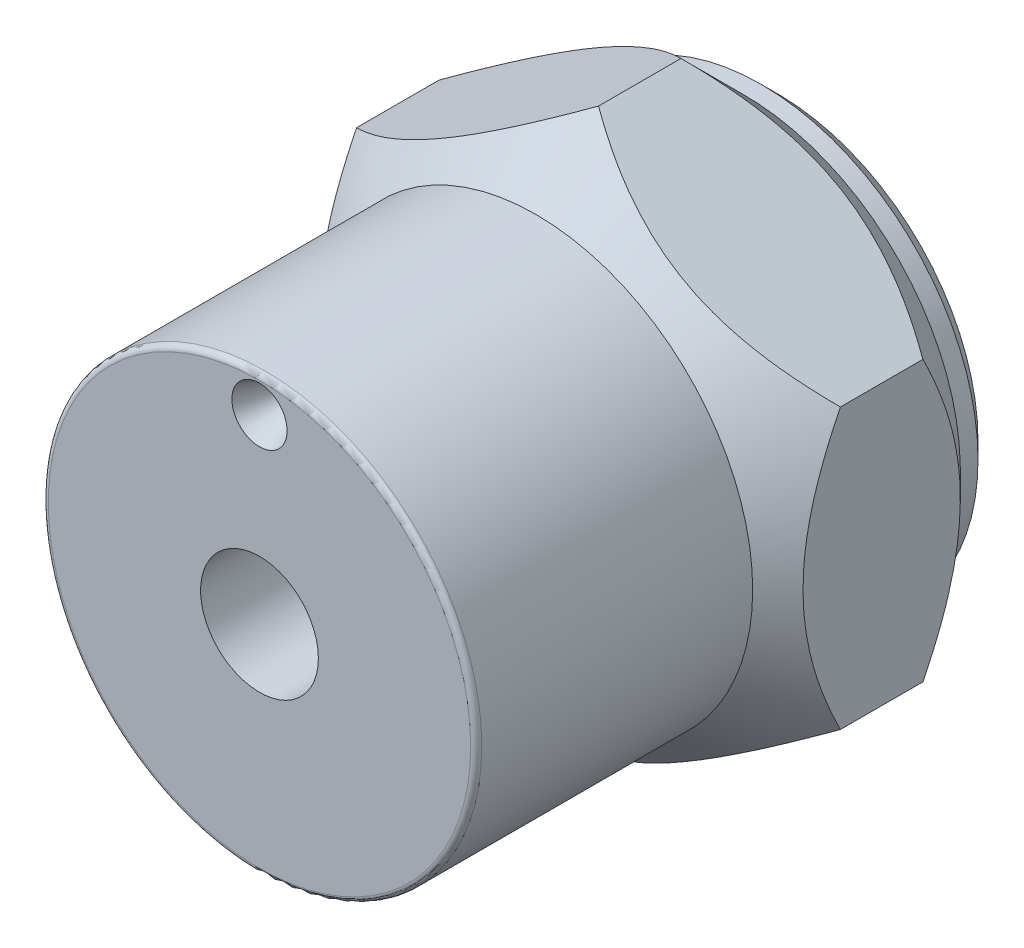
ISO-10303-21;
HEADER;
FILE_DESCRIPTION(('STEP AP214'),'2;1');
FILE_NAME('part.step','',(''),(''),'','','');
FILE_SCHEMA(('AUTOMOTIVE_DESIGN { 1 0 10303 214 1 1 1 1 }'));
ENDSEC;
DATA;
#1=APPLICATION_CONTEXT('core data for automotive mechanical design processes');
#2=APPLICATION_PROTOCOL_DEFINITION('international standard','automotive_design',2000,#1);
#3=PRODUCT_CONTEXT('',#1,'mechanical');
#4=PRODUCT('Part','Part','',(#3));
#5=PRODUCT_RELATED_PRODUCT_CATEGORY('part','',(#4));
#6=PRODUCT_DEFINITION_FORMATION('','',#4);
#7=PRODUCT_DEFINITION_CONTEXT('part definition',#1,'design');
#8=PRODUCT_DEFINITION('design','',#6,#7);
#9=PRODUCT_DEFINITION_SHAPE('','',#8);
#10=(LENGTH_UNIT() NAMED_UNIT(*) SI_UNIT(.MILLI.,.METRE.));
#11=(NAMED_UNIT(*) PLANE_ANGLE_UNIT() SI_UNIT($,.RADIAN.));
#12=(NAMED_UNIT(*) SI_UNIT($,.STERADIAN.) SOLID_ANGLE_UNIT());
#13=UNCERTAINTY_MEASURE_WITH_UNIT(LENGTH_MEASURE(1.E-05),#10,'distance_accuracy_value','');
#14=(GEOMETRIC_REPRESENTATION_CONTEXT(3) GLOBAL_UNCERTAINTY_ASSIGNED_CONTEXT((#13)) GLOBAL_UNIT_ASSIGNED_CONTEXT((#10,
#11,#12)) REPRESENTATION_CONTEXT('',''));
#15=CARTESIAN_POINT('',(0.,0.,0.));
#16=DIRECTION('',(0.,0.,1.));
#17=DIRECTION('',(1.,0.,0.));
#18=AXIS2_PLACEMENT_3D('',#15,#16,#17);
#19=CARTESIAN_POINT('',(0.,-6.41580486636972,11.90625));
#20=DIRECTION('',(-0.500000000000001,0.866025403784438,0.));
#21=DIRECTION('',(-0.866025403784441,-0.5,0.));
#22=AXIS2_PLACEMENT_3D('',#19,#20,#21);
#23=PLANE('',#22);
#24=DIRECTION('',(0.,0.,-1.));
#25=VECTOR('',#24,1.);
#26=CARTESIAN_POINT('',(0.,-6.41580486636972,11.90625));
#27=LINE('',#26,#25);
#28=CARTESIAN_POINT('',(0.,-6.41580486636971,4.11884513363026));
#29=VERTEX_POINT('',#28);
#30=CARTESIAN_POINT('',(0.,-6.41580486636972,2.22480486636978));
#31=VERTEX_POINT('',#30);
#32=EDGE_CURVE('E244',#29,#31,#27,.T.);
#33=ORIENTED_EDGE('',*,*,#32,.T.);
#34=CARTESIAN_POINT('',(-0.000200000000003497,-6.41592033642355,2.2249203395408));
#35=CARTESIAN_POINT('',(0.0953365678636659,-6.36076227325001,2.16976757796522));
#36=CARTESIAN_POINT('',(0.191607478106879,-6.30518023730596,2.11630736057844));
#37=CARTESIAN_POINT('',(0.385762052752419,-6.19308504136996,2.01328688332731));
#38=CARTESIAN_POINT('',(0.483646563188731,-6.13657139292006,1.96372875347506));
#39=CARTESIAN_POINT('',(0.780845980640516,-5.96498322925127,1.82125718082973));
#40=CARTESIAN_POINT('',(0.982676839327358,-5.84845612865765,1.73515435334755));
#41=CARTESIAN_POINT('',(1.38968491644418,-5.6134699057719,1.58770914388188));
#42=CARTESIAN_POINT('',(1.59475810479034,-5.49507084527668,1.52599529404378));
#43=CARTESIAN_POINT('',(1.90573939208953,-5.31552571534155,1.45460749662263));
#44=CARTESIAN_POINT('',(2.00985767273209,-5.255412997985,1.43435160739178));
#45=CARTESIAN_POINT('',(2.21897582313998,-5.13467857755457,1.40135919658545));
#46=CARTESIAN_POINT('',(2.32397555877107,-5.07405695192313,1.38862155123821));
#47=CARTESIAN_POINT('',(2.57984446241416,-4.92633097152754,1.36726512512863));
#48=CARTESIAN_POINT('',(2.7309893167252,-4.83906744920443,1.36278407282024));
#49=CARTESIAN_POINT('',(3.03300662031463,-4.66469767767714,1.37030480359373));
#50=CARTESIAN_POINT('',(3.18387895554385,-4.57759149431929,1.38231236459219));
#51=CARTESIAN_POINT('',(3.48420123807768,-4.40420034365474,1.42210252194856));
#52=CARTESIAN_POINT('',(3.63364940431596,-4.31791640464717,1.44990275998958));
#53=CARTESIAN_POINT('',(3.92997709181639,-4.14683153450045,1.51976687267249));
#54=CARTESIAN_POINT('',(4.0768568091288,-4.06203049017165,1.56182965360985));
#55=CARTESIAN_POINT('',(4.33759648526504,-3.91149236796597,1.64836636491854));
#56=CARTESIAN_POINT('',(4.45203376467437,-3.84542197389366,1.69056454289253));
#57=CARTESIAN_POINT('',(4.67885400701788,-3.71446724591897,1.7817611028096));
#58=CARTESIAN_POINT('',(4.79123690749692,-3.64958294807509,1.83075969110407));
#59=CARTESIAN_POINT('',(5.01359442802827,-3.52120477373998,1.93445867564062));
#60=CARTESIAN_POINT('',(5.12357537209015,-3.45770724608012,1.98914114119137));
#61=CARTESIAN_POINT('',(5.34150068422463,-3.33188800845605,2.10348993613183));
#62=CARTESIAN_POINT('',(5.44944625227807,-3.26956560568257,2.16315320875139));
#63=CARTESIAN_POINT('',(5.55645000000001,-3.20778696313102,2.2249203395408));
#64=B_SPLINE_CURVE_WITH_KNOTS('',3,(#34,#35,#36,#37,#38,#39,#40,#41,#42,#43,#44,#45,#46,#47,#48,
#49,#50,#51,#52,#53,#54,#55,#56,#57,#58,#59,#60,#61,#62,#63),.UNSPECIFIED.,.F.,.F.,(4,2,2,2,2,2,
2,2,2,2,2,2,2,2,4),(0.,0.369982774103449,0.740166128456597,1.48452951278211,2.21707291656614,
2.58262618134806,2.94812479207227,3.47106468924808,3.99418788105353,4.51789659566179,
5.04156515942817,5.45751515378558,5.87347777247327,6.28816585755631,6.70260128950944),.UNSPECIFIED.);
#65=CARTESIAN_POINT('',(5.55625000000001,-3.20790243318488,2.22480486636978));
#66=VERTEX_POINT('',#65);
#67=EDGE_CURVE('E53',#31,#66,#64,.T.);
#68=ORIENTED_EDGE('',*,*,#67,.T.);
#69=DIRECTION('',(0.,0.,-1.));
#70=VECTOR('',#69,1.);
#71=CARTESIAN_POINT('',(5.55625000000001,-3.20790243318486,11.90625));
#72=LINE('',#71,#70);
#73=CARTESIAN_POINT('',(5.55625000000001,-3.20790243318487,4.11884513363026));
#74=VERTEX_POINT('',#73);
#75=EDGE_CURVE('E259',#74,#66,#72,.T.);
#76=ORIENTED_EDGE('',*,*,#75,.F.);
#77=CARTESIAN_POINT('',(5.55645000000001,-3.20778696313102,4.11872966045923));
#78=CARTESIAN_POINT('',(5.46091343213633,-3.26294502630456,4.1738824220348));
#79=CARTESIAN_POINT('',(5.36464252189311,-3.31852706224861,4.22734263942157));
#80=CARTESIAN_POINT('',(5.17048794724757,-3.43062225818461,4.3303631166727));
#81=CARTESIAN_POINT('',(5.07260343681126,-3.48713590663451,4.37992124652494));
#82=CARTESIAN_POINT('',(4.77540401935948,-3.65872407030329,4.52239281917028));
#83=CARTESIAN_POINT('',(4.57357316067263,-3.77525117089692,4.60849564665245));
#84=CARTESIAN_POINT('',(4.16656508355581,-4.01023739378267,4.75594085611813));
#85=CARTESIAN_POINT('',(3.96149189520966,-4.12863645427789,4.81765470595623));
#86=CARTESIAN_POINT('',(3.65051060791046,-4.30818158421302,4.88904250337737));
#87=CARTESIAN_POINT('',(3.54639232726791,-4.36829430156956,4.90929839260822));
#88=CARTESIAN_POINT('',(3.33727417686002,-4.48902872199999,4.94229080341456));
#89=CARTESIAN_POINT('',(3.23227444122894,-4.54965034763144,4.95502844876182));
#90=CARTESIAN_POINT('',(2.97640553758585,-4.69737632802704,4.97638487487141));
#91=CARTESIAN_POINT('',(2.82526068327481,-4.78463985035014,4.98086592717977));
#92=CARTESIAN_POINT('',(2.52324337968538,-4.95900962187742,4.97334519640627));
#93=CARTESIAN_POINT('',(2.37237104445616,-5.04611580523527,4.96133763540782));
#94=CARTESIAN_POINT('',(2.07204876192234,-5.21950695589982,4.92154747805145));
#95=CARTESIAN_POINT('',(1.92260059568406,-5.30579089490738,4.89374724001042));
#96=CARTESIAN_POINT('',(1.62627290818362,-5.4768757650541,4.82388312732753));
#97=CARTESIAN_POINT('',(1.47939319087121,-5.56167680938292,4.78182034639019));
#98=CARTESIAN_POINT('',(1.21865351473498,-5.71221493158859,4.69528363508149));
#99=CARTESIAN_POINT('',(1.10421623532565,-5.77828532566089,4.65308545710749));
#100=CARTESIAN_POINT('',(0.877395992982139,-5.90924005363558,4.5618888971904));
#101=CARTESIAN_POINT('',(0.765013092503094,-5.97412435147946,4.51289030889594));
#102=CARTESIAN_POINT('',(0.542655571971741,-6.10250252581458,4.40919132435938));
#103=CARTESIAN_POINT('',(0.432674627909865,-6.16600005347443,4.35450885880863));
#104=CARTESIAN_POINT('',(0.21474931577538,-6.29181929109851,4.24016006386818));
#105=CARTESIAN_POINT('',(0.106803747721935,-6.35414169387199,4.18049679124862));
#106=CARTESIAN_POINT('',(-0.000200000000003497,-6.41592033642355,4.11872966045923));
#107=B_SPLINE_CURVE_WITH_KNOTS('',3,(#77,#78,#79,#80,#81,#82,#83,#84,#85,#86,#87,#88,#89,#90,
#91,#92,#93,#94,#95,#96,#97,#98,#99,#100,#101,#102,#103,#104,#105,#106),.UNSPECIFIED.,.F.,.F.,
(4,2,2,2,2,2,2,2,2,2,2,2,2,2,4),(0.,0.369982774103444,0.740166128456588,1.4845295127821,
2.21707291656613,2.58262618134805,2.94812479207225,3.47106468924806,3.9941878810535,
4.51789659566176,5.04156515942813,5.45751515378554,5.87347777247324,6.28816585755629,
6.70260128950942),.UNSPECIFIED.);
#108=EDGE_CURVE('E198',#74,#29,#107,.T.);
#109=ORIENTED_EDGE('',*,*,#108,.T.);
#110=EDGE_LOOP('',(#33,#68,#76,#109));
#111=FACE_BOUND('',#110,.T.);
#112=ADVANCED_FACE('F30',(#111),#23,.F.);
#113=CARTESIAN_POINT('',(5.55625000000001,-3.20790243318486,11.90625));
#114=DIRECTION('',(-1.,0.,0.));
#115=DIRECTION('',(0.,-0.999999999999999,0.));
#116=AXIS2_PLACEMENT_3D('',#113,#114,#115);
#117=PLANE('',#116);
#118=ORIENTED_EDGE('',*,*,#75,.T.);
#119=CARTESIAN_POINT('',(5.55625000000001,-6.46362210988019,4.33251599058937));
#120=CARTESIAN_POINT('',(5.55625000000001,-6.3065329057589,4.21341784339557));
#121=CARTESIAN_POINT('',(5.55625000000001,-6.14857156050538,4.09545146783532));
#122=CARTESIAN_POINT('',(5.55625000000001,-5.83055773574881,3.86229133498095));
#123=CARTESIAN_POINT('',(5.55625000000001,-5.67050474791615,3.74709827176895));
#124=CARTESIAN_POINT('',(5.55625000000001,-5.34678986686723,3.51917436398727));
#125=CARTESIAN_POINT('',(5.55625000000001,-5.18310962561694,3.40646949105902));
#126=CARTESIAN_POINT('',(5.55625000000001,-4.8529824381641,3.18520073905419));
#127=CARTESIAN_POINT('',(5.55625000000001,-4.68653568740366,3.07663656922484));
#128=CARTESIAN_POINT('',(5.55625000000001,-4.34059266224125,2.85836881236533));
#129=CARTESIAN_POINT('',(5.55625000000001,-4.16090281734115,2.74897047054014));
#130=CARTESIAN_POINT('',(5.55625000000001,-3.79732199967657,2.53727735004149));
#131=CARTESIAN_POINT('',(5.55625000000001,-3.61343035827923,2.43498371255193));
#132=CARTESIAN_POINT('',(5.55625000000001,-3.24144791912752,2.23970086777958));
#133=CARTESIAN_POINT('',(5.55625000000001,-3.05337159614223,2.14668430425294));
#134=CARTESIAN_POINT('',(5.55625000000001,-2.67204648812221,1.97203841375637));
#135=CARTESIAN_POINT('',(5.55625000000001,-2.47880011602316,1.89040388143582));
#136=CARTESIAN_POINT('',(5.55625000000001,-2.10341456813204,1.74775034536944));
#137=CARTESIAN_POINT('',(5.55625000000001,-1.92172099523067,1.68557085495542));
#138=CARTESIAN_POINT('',(5.55625000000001,-1.55390192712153,1.57577964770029));
#139=CARTESIAN_POINT('',(5.55625000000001,-1.36777613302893,1.52816891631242));
#140=CARTESIAN_POINT('',(5.55625000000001,-0.995331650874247,1.45081352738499));
#141=CARTESIAN_POINT('',(5.55625000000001,-0.80907845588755,1.42075871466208));
#142=CARTESIAN_POINT('',(5.55625000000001,-0.434508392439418,1.3791089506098));
#143=CARTESIAN_POINT('',(5.55625000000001,-0.246191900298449,1.36751068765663));
#144=CARTESIAN_POINT('',(5.55625000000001,0.123517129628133,1.36366417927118));
#145=CARTESIAN_POINT('',(5.55625,0.304902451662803,1.37070141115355));
#146=CARTESIAN_POINT('',(5.55625,0.666151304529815,1.40214514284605));
#147=CARTESIAN_POINT('',(5.55625,0.846014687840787,1.42655330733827));
#148=CARTESIAN_POINT('',(5.55625,1.20596003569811,1.49181154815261));
#149=CARTESIAN_POINT('',(5.55625,1.3859900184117,1.5329437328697));
#150=CARTESIAN_POINT('',(5.55625000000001,1.74211887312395,1.62943678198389));
#151=CARTESIAN_POINT('',(5.55625000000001,1.91821804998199,1.68479653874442));
#152=CARTESIAN_POINT('',(5.55625000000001,2.28095281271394,1.81261832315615));
#153=CARTESIAN_POINT('',(5.55625,2.46721345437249,1.88613336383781));
#154=CARTESIAN_POINT('',(5.55625,2.83490880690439,2.04446817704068));
#155=CARTESIAN_POINT('',(5.55625,3.01634124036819,2.12929317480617));
#156=CARTESIAN_POINT('',(5.55625,3.37525935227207,2.30823154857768));
#157=CARTESIAN_POINT('',(5.55625,3.55273043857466,2.40237395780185));
#158=CARTESIAN_POINT('',(5.55625,3.90359298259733,2.59786857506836));
#159=CARTESIAN_POINT('',(5.55625,4.07698507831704,2.69921964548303));
#160=CARTESIAN_POINT('',(5.55625,4.4117075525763,2.90253922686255));
#161=CARTESIAN_POINT('',(5.55625,4.57320929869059,3.00422710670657));
#162=CARTESIAN_POINT('',(5.55625,4.89343958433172,3.21189254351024));
#163=CARTESIAN_POINT('',(5.55625,5.05216791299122,3.31787042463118));
#164=CARTESIAN_POINT('',(5.55625,5.36592978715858,3.53247724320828));
#165=CARTESIAN_POINT('',(5.55625,5.52098284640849,3.64107775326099));
#166=CARTESIAN_POINT('',(5.55625,5.82896783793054,3.86116087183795));
#167=CARTESIAN_POINT('',(5.55625,5.98190034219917,3.97264267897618));
#168=CARTESIAN_POINT('',(5.55625,6.13394446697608,4.08530284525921));
#169=B_SPLINE_CURVE_WITH_KNOTS('',3,(#119,#120,#121,#122,#123,#124,#125,#126,#127,#128,#129,
#130,#131,#132,#133,#134,#135,#136,#137,#138,#139,#140,#141,#142,#143,#144,#145,#146,#147,#148,
#149,#150,#151,#152,#153,#154,#155,#156,#157,#158,#159,#160,#161,#162,#163,#164,#165,#166,#167,
#168),.UNSPECIFIED.,.F.,.F.,(4,2,2,2,2,2,2,2,2,2,2,2,2,2,2,2,2,2,2,2,2,2,2,2,4),(0.,
0.591410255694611,1.1829670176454,1.77910425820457,2.37519956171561,3.00618537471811,
3.63727230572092,4.26643955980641,4.89531812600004,5.4709302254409,6.04658125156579,
6.6117281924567,7.17677371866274,7.72047079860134,8.26421998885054,8.81754933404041,
9.3708356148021,9.97110049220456,10.5716436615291,11.1741208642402,11.7765031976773,
12.3489697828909,12.9214797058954,13.489352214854,14.0570684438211),.UNSPECIFIED.);
#170=CARTESIAN_POINT('',(5.55625000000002,3.20790243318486,2.22480486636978));
#171=VERTEX_POINT('',#170);
#172=EDGE_CURVE('E211',#66,#171,#169,.T.);
#173=ORIENTED_EDGE('',*,*,#172,.T.);
#174=DIRECTION('',(0.,0.,-1.));
#175=VECTOR('',#174,1.);
#176=CARTESIAN_POINT('',(5.55625000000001,3.20790243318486,11.90625));
#177=LINE('',#176,#175);
#178=CARTESIAN_POINT('',(5.55625000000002,3.20790243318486,4.11884513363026));
#179=VERTEX_POINT('',#178);
#180=EDGE_CURVE('E257',#179,#171,#177,.T.);
#181=ORIENTED_EDGE('',*,*,#180,.F.);
#182=CARTESIAN_POINT('',(5.55625000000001,-6.46362210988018,2.01113400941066));
#183=CARTESIAN_POINT('',(5.55625000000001,-6.30653290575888,2.13023215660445));
#184=CARTESIAN_POINT('',(5.55625000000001,-6.14857156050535,2.24819853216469));
#185=CARTESIAN_POINT('',(5.55625000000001,-5.83055773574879,2.48135866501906));
#186=CARTESIAN_POINT('',(5.55625000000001,-5.67050474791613,2.59655172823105));
#187=CARTESIAN_POINT('',(5.55625000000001,-5.34678986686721,2.82447563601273));
#188=CARTESIAN_POINT('',(5.55625000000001,-5.18310962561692,2.93718050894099));
#189=CARTESIAN_POINT('',(5.55625000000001,-4.85298243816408,3.15844926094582));
#190=CARTESIAN_POINT('',(5.55625000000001,-4.68653568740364,3.26701343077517));
#191=CARTESIAN_POINT('',(5.55625000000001,-4.34059266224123,3.48528118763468));
#192=CARTESIAN_POINT('',(5.55625000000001,-4.16090281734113,3.59467952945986));
#193=CARTESIAN_POINT('',(5.55625000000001,-3.79732199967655,3.80637264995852));
#194=CARTESIAN_POINT('',(5.55625000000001,-3.61343035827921,3.90866628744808));
#195=CARTESIAN_POINT('',(5.55625000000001,-3.24144791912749,4.10394913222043));
#196=CARTESIAN_POINT('',(5.55625000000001,-3.0533715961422,4.19696569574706));
#197=CARTESIAN_POINT('',(5.55625000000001,-2.6720464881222,4.37161158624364));
#198=CARTESIAN_POINT('',(5.55625000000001,-2.47880011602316,4.45324611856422));
#199=CARTESIAN_POINT('',(5.55625000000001,-2.10341456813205,4.59589965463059));
#200=CARTESIAN_POINT('',(5.55625000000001,-1.92172099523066,4.65807914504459));
#201=CARTESIAN_POINT('',(5.55625000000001,-1.55390192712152,4.76787035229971));
#202=CARTESIAN_POINT('',(5.55625000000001,-1.36777613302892,4.81548108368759));
#203=CARTESIAN_POINT('',(5.55625000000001,-0.995331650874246,4.89283647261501));
#204=CARTESIAN_POINT('',(5.55625,-0.809078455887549,4.92289128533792));
#205=CARTESIAN_POINT('',(5.55625000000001,-0.434508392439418,4.96454104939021));
#206=CARTESIAN_POINT('',(5.55625000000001,-0.246191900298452,4.9761393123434));
#207=CARTESIAN_POINT('',(5.55625000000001,0.123517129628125,4.97998582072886));
#208=CARTESIAN_POINT('',(5.55625000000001,0.304902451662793,4.97294858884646));
#209=CARTESIAN_POINT('',(5.55625,0.666151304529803,4.94150485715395));
#210=CARTESIAN_POINT('',(5.55625,0.846014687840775,4.91709669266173));
#211=CARTESIAN_POINT('',(5.55625,1.20596003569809,4.8518384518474));
#212=CARTESIAN_POINT('',(5.55625,1.38599001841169,4.8107062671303));
#213=CARTESIAN_POINT('',(5.55625,1.74211887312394,4.71421321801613));
#214=CARTESIAN_POINT('',(5.55625,1.91821804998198,4.65885346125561));
#215=CARTESIAN_POINT('',(5.55625,2.28095281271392,4.53103167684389));
#216=CARTESIAN_POINT('',(5.55625,2.46721345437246,4.45751663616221));
#217=CARTESIAN_POINT('',(5.55625,2.83490880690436,4.29918182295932));
#218=CARTESIAN_POINT('',(5.55625,3.01634124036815,4.21435682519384));
#219=CARTESIAN_POINT('',(5.55625,3.37525935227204,4.03541845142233));
#220=CARTESIAN_POINT('',(5.55625,3.55273043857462,3.94127604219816));
#221=CARTESIAN_POINT('',(5.55625,3.90359298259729,3.74578142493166));
#222=CARTESIAN_POINT('',(5.55625,4.076985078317,3.64443035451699));
#223=CARTESIAN_POINT('',(5.55625,4.41170755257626,3.44111077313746));
#224=CARTESIAN_POINT('',(5.55625,4.57320929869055,3.33942289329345));
#225=CARTESIAN_POINT('',(5.55625,4.89343958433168,3.13175745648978));
#226=CARTESIAN_POINT('',(5.55625,5.05216791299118,3.02577957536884));
#227=CARTESIAN_POINT('',(5.55625,5.36592978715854,2.81117275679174));
#228=CARTESIAN_POINT('',(5.55625,5.52098284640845,2.70257224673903));
#229=CARTESIAN_POINT('',(5.55625,5.8289678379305,2.48248912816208));
#230=CARTESIAN_POINT('',(5.55625,5.98190034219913,2.37100732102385));
#231=CARTESIAN_POINT('',(5.55625,6.13394446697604,2.25834715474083));
#232=B_SPLINE_CURVE_WITH_KNOTS('',3,(#182,#183,#184,#185,#186,#187,#188,#189,#190,#191,#192,
#193,#194,#195,#196,#197,#198,#199,#200,#201,#202,#203,#204,#205,#206,#207,#208,#209,#210,#211,
#212,#213,#214,#215,#216,#217,#218,#219,#220,#221,#222,#223,#224,#225,#226,#227,#228,#229,#230,
#231),.UNSPECIFIED.,.F.,.F.,(4,2,2,2,2,2,2,2,2,2,2,2,2,2,2,2,2,2,2,2,2,2,2,2,4),(0.,
0.591410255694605,1.18296701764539,1.77910425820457,2.3751995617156,3.0061853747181,
3.63727230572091,4.2664395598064,4.89531812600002,5.47093022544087,6.04658125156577,
6.61172819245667,7.17677371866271,7.72047079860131,8.2642199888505,8.81754933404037,
9.37083561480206,9.97110049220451,10.571643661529,11.1741208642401,11.7765031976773,
12.3489697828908,12.9214797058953,13.489352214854,14.0570684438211),.UNSPECIFIED.);
#233=EDGE_CURVE('E193',#179,#74,#232,.F.);
#234=ORIENTED_EDGE('',*,*,#233,.T.);
#235=EDGE_LOOP('',(#118,#173,#181,#234));
#236=FACE_BOUND('',#235,.T.);
#237=ADVANCED_FACE('F203',(#236),#117,.F.);
#238=CARTESIAN_POINT('',(5.55625000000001,3.20790243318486,11.90625));
#239=DIRECTION('',(-0.500000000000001,-0.866025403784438,0.));
#240=DIRECTION('',(0.866025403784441,-0.5,0.));
#241=AXIS2_PLACEMENT_3D('',#238,#239,#240);
#242=PLANE('',#241);
#243=ORIENTED_EDGE('',*,*,#180,.T.);
#244=CARTESIAN_POINT('',(5.55645,3.20778696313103,2.2249203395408));
#245=CARTESIAN_POINT('',(5.46091343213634,3.26294502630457,2.16976757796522));
#246=CARTESIAN_POINT('',(5.36464252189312,3.31852706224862,2.11630736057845));
#247=CARTESIAN_POINT('',(5.17048794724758,3.43062225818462,2.01328688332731));
#248=CARTESIAN_POINT('',(5.07260343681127,3.48713590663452,1.96372875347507));
#249=CARTESIAN_POINT('',(4.77540401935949,3.65872407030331,1.82125718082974));
#250=CARTESIAN_POINT('',(4.57357316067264,3.77525117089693,1.73515435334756));
#251=CARTESIAN_POINT('',(4.16656508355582,4.01023739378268,1.58770914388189));
#252=CARTESIAN_POINT('',(3.96149189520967,4.1286364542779,1.52599529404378));
#253=CARTESIAN_POINT('',(3.65051060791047,4.30818158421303,1.45460749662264));
#254=CARTESIAN_POINT('',(3.54639232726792,4.36829430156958,1.4343516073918));
#255=CARTESIAN_POINT('',(3.33727417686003,4.489028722,1.40135919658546));
#256=CARTESIAN_POINT('',(3.23227444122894,4.54965034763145,1.38862155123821));
#257=CARTESIAN_POINT('',(2.97640553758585,4.69737632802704,1.36726512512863));
#258=CARTESIAN_POINT('',(2.82526068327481,4.78463985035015,1.36278407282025));
#259=CARTESIAN_POINT('',(2.52324337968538,4.95900962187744,1.37030480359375));
#260=CARTESIAN_POINT('',(2.37237104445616,5.04611580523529,1.3823123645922));
#261=CARTESIAN_POINT('',(2.07204876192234,5.21950695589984,1.42210252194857));
#262=CARTESIAN_POINT('',(1.92260059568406,5.30579089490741,1.4499027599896));
#263=CARTESIAN_POINT('',(1.62627290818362,5.47687576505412,1.5197668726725));
#264=CARTESIAN_POINT('',(1.4793931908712,5.56167680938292,1.56182965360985));
#265=CARTESIAN_POINT('',(1.21865351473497,5.7122149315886,1.64836636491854));
#266=CARTESIAN_POINT('',(1.10421623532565,5.77828532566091,1.69056454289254));
#267=CARTESIAN_POINT('',(0.877395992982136,5.9092400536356,1.78176110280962));
#268=CARTESIAN_POINT('',(0.76501309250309,5.97412435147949,1.83075969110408));
#269=CARTESIAN_POINT('',(0.542655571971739,6.1025025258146,1.93445867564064));
#270=CARTESIAN_POINT('',(0.432674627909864,6.16600005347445,1.98914114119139));
#271=CARTESIAN_POINT('',(0.21474931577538,6.29181929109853,2.10348993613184));
#272=CARTESIAN_POINT('',(0.106803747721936,6.35414169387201,2.1631532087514));
#273=CARTESIAN_POINT('',(-0.000200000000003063,6.41592033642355,2.2249203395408));
#274=B_SPLINE_CURVE_WITH_KNOTS('',3,(#244,#245,#246,#247,#248,#249,#250,#251,#252,#253,#254,
#255,#256,#257,#258,#259,#260,#261,#262,#263,#264,#265,#266,#267,#268,#269,#270,#271,#272,#273),
.UNSPECIFIED.,.F.,.F.,(4,2,2,2,2,2,2,2,2,2,2,2,2,2,4),(0.,0.369982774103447,0.740166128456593,
1.4845295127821,2.21707291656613,2.58262618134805,2.94812479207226,3.47106468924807,
3.99418788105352,4.51789659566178,5.04156515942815,5.45751515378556,5.87347777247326,
6.2881658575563,6.70260128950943),.UNSPECIFIED.);
#275=CARTESIAN_POINT('',(0.,6.41580486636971,2.22480486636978));
#276=VERTEX_POINT('',#275);
#277=EDGE_CURVE('E216',#171,#276,#274,.T.);
#278=ORIENTED_EDGE('',*,*,#277,.T.);
#279=DIRECTION('',(0.,0.,-1.));
#280=VECTOR('',#279,1.);
#281=CARTESIAN_POINT('',(0.,6.41580486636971,11.90625));
#282=LINE('',#281,#280);
#283=CARTESIAN_POINT('',(0.,6.41580486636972,4.11884513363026));
#284=VERTEX_POINT('',#283);
#285=EDGE_CURVE('E254',#284,#276,#282,.T.);
#286=ORIENTED_EDGE('',*,*,#285,.F.);
#287=CARTESIAN_POINT('',(-0.000200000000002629,6.41592033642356,4.11872966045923));
#288=CARTESIAN_POINT('',(0.0953365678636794,6.36076227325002,4.17388242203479));
#289=CARTESIAN_POINT('',(0.191607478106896,6.30518023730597,4.22734263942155));
#290=CARTESIAN_POINT('',(0.385762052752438,6.19308504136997,4.33036311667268));
#291=CARTESIAN_POINT('',(0.483646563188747,6.13657139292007,4.37992124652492));
#292=CARTESIAN_POINT('',(0.78084598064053,5.96498322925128,4.52239281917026));
#293=CARTESIAN_POINT('',(0.982676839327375,5.84845612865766,4.60849564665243));
#294=CARTESIAN_POINT('',(1.3896849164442,5.61346990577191,4.75594085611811));
#295=CARTESIAN_POINT('',(1.59475810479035,5.49507084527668,4.81765470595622));
#296=CARTESIAN_POINT('',(1.90573939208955,5.31552571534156,4.88904250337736));
#297=CARTESIAN_POINT('',(2.00985767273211,5.25541299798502,4.9092983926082));
#298=CARTESIAN_POINT('',(2.21897582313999,5.13467857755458,4.94229080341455));
#299=CARTESIAN_POINT('',(2.32397555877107,5.07405695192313,4.95502844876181));
#300=CARTESIAN_POINT('',(2.57984446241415,4.92633097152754,4.97638487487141));
#301=CARTESIAN_POINT('',(2.7309893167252,4.83906744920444,4.98086592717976));
#302=CARTESIAN_POINT('',(3.03300662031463,4.66469767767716,4.97334519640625));
#303=CARTESIAN_POINT('',(3.18387895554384,4.57759149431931,4.9613376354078));
#304=CARTESIAN_POINT('',(3.48420123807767,4.40420034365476,4.92154747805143));
#305=CARTESIAN_POINT('',(3.63364940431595,4.3179164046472,4.8937472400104));
#306=CARTESIAN_POINT('',(3.92997709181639,4.14683153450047,4.82388312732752));
#307=CARTESIAN_POINT('',(4.07685680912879,4.06203049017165,4.78182034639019));
#308=CARTESIAN_POINT('',(4.33759648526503,3.91149236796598,4.69528363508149));
#309=CARTESIAN_POINT('',(4.45203376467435,3.84542197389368,4.65308545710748));
#310=CARTESIAN_POINT('',(4.67885400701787,3.714467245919,4.56188889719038));
#311=CARTESIAN_POINT('',(4.79123690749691,3.64958294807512,4.51289030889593));
#312=CARTESIAN_POINT('',(5.01359442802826,3.52120477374,4.40919132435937));
#313=CARTESIAN_POINT('',(5.12357537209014,3.45770724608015,4.35450885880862));
#314=CARTESIAN_POINT('',(5.34150068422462,3.33188800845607,4.24016006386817));
#315=CARTESIAN_POINT('',(5.44944625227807,3.26956560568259,4.18049679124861));
#316=CARTESIAN_POINT('',(5.55645000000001,3.20778696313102,4.11872966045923));
#317=B_SPLINE_CURVE_WITH_KNOTS('',3,(#287,#288,#289,#290,#291,#292,#293,#294,#295,#296,#297,
#298,#299,#300,#301,#302,#303,#304,#305,#306,#307,#308,#309,#310,#311,#312,#313,#314,#315,#316),
.UNSPECIFIED.,.F.,.F.,(4,2,2,2,2,2,2,2,2,2,2,2,2,2,4),(0.,0.369982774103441,0.740166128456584,
1.4845295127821,2.21707291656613,2.58262618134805,2.94812479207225,3.47106468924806,
3.9941878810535,4.51789659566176,5.04156515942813,5.45751515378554,5.87347777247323,
6.28816585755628,6.70260128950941),.UNSPECIFIED.);
#318=EDGE_CURVE('E188',#284,#179,#317,.T.);
#319=ORIENTED_EDGE('',*,*,#318,.T.);
#320=EDGE_LOOP('',(#243,#278,#286,#319));
#321=FACE_BOUND('',#320,.T.);
#322=ADVANCED_FACE('F206',(#321),#242,.F.);
#323=CARTESIAN_POINT('',(0.,6.41580486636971,11.90625));
#324=DIRECTION('',(0.500000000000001,-0.866025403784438,0.));
#325=DIRECTION('',(0.866025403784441,0.499999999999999,0.));
#326=AXIS2_PLACEMENT_3D('',#323,#324,#325);
#327=PLANE('',#326);
#328=ORIENTED_EDGE('',*,*,#285,.T.);
#329=CARTESIAN_POINT('',(0.000199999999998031,6.41592033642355,2.2249203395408));
#330=CARTESIAN_POINT('',(-0.0953365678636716,6.36076227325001,2.16976757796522));
#331=CARTESIAN_POINT('',(-0.191607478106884,6.30518023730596,2.11630736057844));
#332=CARTESIAN_POINT('',(-0.385762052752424,6.19308504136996,2.01328688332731));
#333=CARTESIAN_POINT('',(-0.483646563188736,6.13657139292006,1.96372875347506));
#334=CARTESIAN_POINT('',(-0.780845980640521,5.96498322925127,1.82125718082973));
#335=CARTESIAN_POINT('',(-0.982676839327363,5.84845612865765,1.73515435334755));
#336=CARTESIAN_POINT('',(-1.38968491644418,5.6134699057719,1.58770914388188));
#337=CARTESIAN_POINT('',(-1.59475810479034,5.49507084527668,1.52599529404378));
#338=CARTESIAN_POINT('',(-1.90573939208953,5.31552571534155,1.45460749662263));
#339=CARTESIAN_POINT('',(-2.00985767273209,5.255412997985,1.43435160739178));
#340=CARTESIAN_POINT('',(-2.21897582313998,5.13467857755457,1.40135919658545));
#341=CARTESIAN_POINT('',(-2.32397555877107,5.07405695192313,1.38862155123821));
#342=CARTESIAN_POINT('',(-2.57984446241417,4.92633097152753,1.36726512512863));
#343=CARTESIAN_POINT('',(-2.7309893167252,4.83906744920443,1.36278407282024));
#344=CARTESIAN_POINT('',(-3.03300662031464,4.66469767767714,1.37030480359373));
#345=CARTESIAN_POINT('',(-3.18387895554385,4.57759149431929,1.38231236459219));
#346=CARTESIAN_POINT('',(-3.48420123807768,4.40420034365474,1.42210252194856));
#347=CARTESIAN_POINT('',(-3.63364940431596,4.31791640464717,1.44990275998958));
#348=CARTESIAN_POINT('',(-3.9299770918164,4.14683153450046,1.51976687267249));
#349=CARTESIAN_POINT('',(-4.07685680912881,4.06203049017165,1.56182965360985));
#350=CARTESIAN_POINT('',(-4.33759648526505,3.91149236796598,1.64836636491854));
#351=CARTESIAN_POINT('',(-4.45203376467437,3.84542197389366,1.69056454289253));
#352=CARTESIAN_POINT('',(-4.67885400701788,3.71446724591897,1.7817611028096));
#353=CARTESIAN_POINT('',(-4.79123690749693,3.64958294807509,1.83075969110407));
#354=CARTESIAN_POINT('',(-5.01359442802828,3.52120477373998,1.93445867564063));
#355=CARTESIAN_POINT('',(-5.12357537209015,3.45770724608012,1.98914114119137));
#356=CARTESIAN_POINT('',(-5.34150068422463,3.33188800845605,2.10348993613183));
#357=CARTESIAN_POINT('',(-5.44944625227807,3.26956560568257,2.16315320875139));
#358=CARTESIAN_POINT('',(-5.55645000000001,3.20778696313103,2.2249203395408));
#359=B_SPLINE_CURVE_WITH_KNOTS('',3,(#329,#330,#331,#332,#333,#334,#335,#336,#337,#338,#339,
#340,#341,#342,#343,#344,#345,#346,#347,#348,#349,#350,#351,#352,#353,#354,#355,#356,#357,#358),
.UNSPECIFIED.,.F.,.F.,(4,2,2,2,2,2,2,2,2,2,2,2,2,2,4),(0.,0.369982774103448,0.740166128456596,
1.4845295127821,2.21707291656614,2.58262618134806,2.94812479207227,3.47106468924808,
3.99418788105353,4.51789659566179,5.04156515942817,5.45751515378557,5.87347777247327,
6.28816585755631,6.70260128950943),.UNSPECIFIED.);
#360=CARTESIAN_POINT('',(-5.55625000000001,3.20790243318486,2.22480486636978));
#361=VERTEX_POINT('',#360);
#362=EDGE_CURVE('E130',#276,#361,#359,.T.);
#363=ORIENTED_EDGE('',*,*,#362,.T.);
#364=DIRECTION('',(0.,0.,-1.));
#365=VECTOR('',#364,1.);
#366=CARTESIAN_POINT('',(-5.55625000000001,3.20790243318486,11.90625));
#367=LINE('',#366,#365);
#368=CARTESIAN_POINT('',(-5.55625000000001,3.20790243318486,4.11884513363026));
#369=VERTEX_POINT('',#368);
#370=EDGE_CURVE('E249',#369,#361,#367,.T.);
#371=ORIENTED_EDGE('',*,*,#370,.F.);
#372=CARTESIAN_POINT('',(-5.55645000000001,3.20778696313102,4.11872966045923));
#373=CARTESIAN_POINT('',(-5.46091343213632,3.26294502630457,4.1738824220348));
#374=CARTESIAN_POINT('',(-5.3646425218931,3.31852706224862,4.22734263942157));
#375=CARTESIAN_POINT('',(-5.17048794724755,3.43062225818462,4.33036311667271));
#376=CARTESIAN_POINT('',(-5.07260343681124,3.48713590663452,4.37992124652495));
#377=CARTESIAN_POINT('',(-4.77540401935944,3.65872407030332,4.52239281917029));
#378=CARTESIAN_POINT('',(-4.57357316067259,3.77525117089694,4.60849564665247));
#379=CARTESIAN_POINT('',(-4.16656508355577,4.01023739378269,4.75594085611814));
#380=CARTESIAN_POINT('',(-3.96149189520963,4.12863645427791,4.81765470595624));
#381=CARTESIAN_POINT('',(-3.65051060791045,4.30818158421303,4.88904250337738));
#382=CARTESIAN_POINT('',(-3.54639232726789,4.36829430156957,4.90929839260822));
#383=CARTESIAN_POINT('',(-3.33727417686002,4.489028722,4.94229080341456));
#384=CARTESIAN_POINT('',(-3.23227444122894,4.54965034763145,4.95502844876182));
#385=CARTESIAN_POINT('',(-2.97640553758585,4.69737632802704,4.97638487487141));
#386=CARTESIAN_POINT('',(-2.82526068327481,4.78463985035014,4.98086592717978));
#387=CARTESIAN_POINT('',(-2.52324337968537,4.95900962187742,4.97334519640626));
#388=CARTESIAN_POINT('',(-2.37237104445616,5.04611580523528,4.9613376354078));
#389=CARTESIAN_POINT('',(-2.07204876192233,5.21950695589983,4.92154747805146));
#390=CARTESIAN_POINT('',(-1.92260059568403,5.3057908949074,4.89374724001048));
#391=CARTESIAN_POINT('',(-1.62627290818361,5.47687576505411,4.82388312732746));
#392=CARTESIAN_POINT('',(-1.47939319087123,5.56167680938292,4.78182034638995));
#393=CARTESIAN_POINT('',(-1.21865351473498,5.7122149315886,4.69528363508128));
#394=CARTESIAN_POINT('',(-1.10421623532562,5.77828532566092,4.65308545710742));
#395=CARTESIAN_POINT('',(-0.877395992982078,5.90924005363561,4.56188889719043));
#396=CARTESIAN_POINT('',(-0.765013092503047,5.97412435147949,4.51289030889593));
#397=CARTESIAN_POINT('',(-0.542655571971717,6.10250252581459,4.40919132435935));
#398=CARTESIAN_POINT('',(-0.432674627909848,6.16600005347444,4.35450885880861));
#399=CARTESIAN_POINT('',(-0.214749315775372,6.29181929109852,4.24016006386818));
#400=CARTESIAN_POINT('',(-0.10680374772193,6.354141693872,4.18049679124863));
#401=CARTESIAN_POINT('',(0.000199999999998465,6.41592033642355,4.11872966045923));
#402=B_SPLINE_CURVE_WITH_KNOTS('',3,(#372,#373,#374,#375,#376,#377,#378,#379,#380,#381,#382,
#383,#384,#385,#386,#387,#388,#389,#390,#391,#392,#393,#394,#395,#396,#397,#398,#399,#400,#401),
.UNSPECIFIED.,.F.,.F.,(4,2,2,2,2,2,2,2,2,2,2,2,2,2,4),(0.,0.369982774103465,0.740166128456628,
1.48452951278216,2.21707291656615,2.58262618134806,2.94812479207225,3.47106468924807,
3.99418788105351,4.51789659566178,5.04156515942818,5.45751515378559,5.87347777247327,
6.28816585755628,6.7026012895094),.UNSPECIFIED.);
#403=EDGE_CURVE('E161',#369,#284,#402,.T.);
#404=ORIENTED_EDGE('',*,*,#403,.T.);
#405=EDGE_LOOP('',(#328,#363,#371,#404));
#406=FACE_BOUND('',#405,.T.);
#407=ADVANCED_FACE('F145',(#406),#327,.F.);
#408=CARTESIAN_POINT('',(-5.55625000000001,3.20790243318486,11.90625));
#409=DIRECTION('',(1.,0.,0.));
#410=DIRECTION('',(0.,0.,-1.));
#411=AXIS2_PLACEMENT_3D('',#408,#409,#410);
#412=PLANE('',#411);
#413=ORIENTED_EDGE('',*,*,#370,.T.);
#414=CARTESIAN_POINT('',(-5.55625000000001,-6.46362210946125,4.33251599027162));
#415=CARTESIAN_POINT('',(-5.55625000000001,-6.30653290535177,4.2134178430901));
#416=CARTESIAN_POINT('',(-5.55625000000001,-6.14857156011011,4.09545146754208));
#417=CARTESIAN_POINT('',(-5.55625000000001,-5.83055773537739,3.86229133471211));
#418=CARTESIAN_POINT('',(-5.55625000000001,-5.67050474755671,3.74709827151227));
#419=CARTESIAN_POINT('',(-5.55625000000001,-5.34678986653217,3.519174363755));
#420=CARTESIAN_POINT('',(-5.55625000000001,-5.18310962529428,3.40646949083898));
#421=CARTESIAN_POINT('',(-5.55625000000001,-4.85298243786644,3.18520073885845));
#422=CARTESIAN_POINT('',(-5.55625000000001,-4.68653568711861,3.07663656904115));
#423=CARTESIAN_POINT('',(-5.55625000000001,-4.34059266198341,2.85836881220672));
#424=CARTESIAN_POINT('',(-5.55625000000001,-4.16090281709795,2.74897047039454));
#425=CARTESIAN_POINT('',(-5.55625000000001,-3.79732199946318,2.53727734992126));
#426=CARTESIAN_POINT('',(-5.55625000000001,-3.613430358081,2.43498371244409));
#427=CARTESIAN_POINT('',(-5.55625000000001,-3.24144791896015,2.23970086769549));
#428=CARTESIAN_POINT('',(-5.55625000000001,-3.05337159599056,2.14668430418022));
#429=CARTESIAN_POINT('',(-5.55625000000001,-2.6720464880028,1.97203841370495));
#430=CARTESIAN_POINT('',(-5.55625000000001,-2.47880011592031,1.89040388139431));
#431=CARTESIAN_POINT('',(-5.55625000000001,-2.10341456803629,1.74775034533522));
#432=CARTESIAN_POINT('',(-5.55625000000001,-1.92172099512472,1.68557085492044));
#433=CARTESIAN_POINT('',(-5.55625000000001,-1.55390192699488,1.57577964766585));
#434=CARTESIAN_POINT('',(-5.55625000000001,-1.36777613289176,1.52816891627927));
#435=CARTESIAN_POINT('',(-5.55625000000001,-0.99533165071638,1.45081352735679));
#436=CARTESIAN_POINT('',(-5.55625000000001,-0.809078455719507,1.42075871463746));
#437=CARTESIAN_POINT('',(-5.55625000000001,-0.434508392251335,1.37910895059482));
#438=CARTESIAN_POINT('',(-5.55625000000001,-0.246191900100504,1.36751068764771));
#439=CARTESIAN_POINT('',(-5.55625000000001,0.12351712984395,1.36366417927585));
#440=CARTESIAN_POINT('',(-5.55625000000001,0.304902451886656,1.37070141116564));
#441=CARTESIAN_POINT('',(-5.55625000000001,0.666151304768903,1.40214514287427));
#442=CARTESIAN_POINT('',(-5.55625000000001,0.846014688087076,1.42655330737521));
#443=CARTESIAN_POINT('',(-5.55625000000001,1.20596003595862,1.49181154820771));
#444=CARTESIAN_POINT('',(-5.55625000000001,1.38599001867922,1.53294373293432));
#445=CARTESIAN_POINT('',(-5.55625000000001,1.74211887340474,1.62943678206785));
#446=CARTESIAN_POINT('',(-5.55625000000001,1.91821805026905,1.68479653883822));
#447=CARTESIAN_POINT('',(-5.55625000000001,2.28095281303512,1.81261832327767));
#448=CARTESIAN_POINT('',(-5.55625000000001,2.46721345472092,1.88613336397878));
#449=CARTESIAN_POINT('',(-5.55625000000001,2.83490880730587,2.04446817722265));
#450=CARTESIAN_POINT('',(-5.55625000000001,3.01634124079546,2.12929317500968));
#451=CARTESIAN_POINT('',(-5.55625000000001,3.37525935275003,2.30823154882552));
#452=CARTESIAN_POINT('',(-5.55625000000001,3.55273043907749,2.4023739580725));
#453=CARTESIAN_POINT('',(-5.55625000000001,3.9035929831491,2.59786857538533));
#454=CARTESIAN_POINT('',(-5.55625000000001,4.07698507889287,2.69921964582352));
#455=CARTESIAN_POINT('',(-5.55625000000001,4.41170755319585,2.90253922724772));
#456=CARTESIAN_POINT('',(-5.55625000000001,4.57320929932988,3.00422710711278));
#457=CARTESIAN_POINT('',(-5.55625000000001,4.89343958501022,3.21189254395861));
#458=CARTESIAN_POINT('',(-5.55625000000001,5.05216791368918,3.31787042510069));
#459=CARTESIAN_POINT('',(-5.55625000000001,5.36592978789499,3.53247724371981));
#460=CARTESIAN_POINT('',(-5.55625000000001,5.52098284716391,3.64107775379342));
#461=CARTESIAN_POINT('',(-5.55625000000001,5.82896783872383,3.86116087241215));
#462=CARTESIAN_POINT('',(-5.55625000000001,5.98190034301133,3.97264267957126));
#463=CARTESIAN_POINT('',(-5.55625000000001,6.13394446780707,4.08530284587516));
#464=B_SPLINE_CURVE_WITH_KNOTS('',3,(#414,#415,#416,#417,#418,#419,#420,#421,#422,#423,#424,
#425,#426,#427,#428,#429,#430,#431,#432,#433,#434,#435,#436,#437,#438,#439,#440,#441,#442,#443,
#444,#445,#446,#447,#448,#449,#450,#451,#452,#453,#454,#455,#456,#457,#458,#459,#460,#461,#462,
#463),.UNSPECIFIED.,.F.,.F.,(4,2,2,2,2,2,2,2,2,2,2,2,2,2,2,2,2,2,2,2,2,2,2,2,4),(0.,
0.59141025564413,1.18296701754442,1.77910425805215,2.37519956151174,3.00618537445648,
3.63727230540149,4.26643955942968,4.8953181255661,5.47093022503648,6.04658125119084,
6.61172819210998,7.17677371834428,7.72047079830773,8.26421998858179,8.81754933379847,
9.37083561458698,9.97110049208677,10.5716436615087,11.1741208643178,11.7765031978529,
12.3489697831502,12.9214797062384,13.4893522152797,14.0570684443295),.UNSPECIFIED.);
#465=CARTESIAN_POINT('',(-5.55625000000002,-3.20790243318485,2.22480486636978));
#466=VERTEX_POINT('',#465);
#467=EDGE_CURVE('E122',#361,#466,#464,.F.);
#468=ORIENTED_EDGE('',*,*,#467,.T.);
#469=DIRECTION('',(0.,0.,-1.));
#470=VECTOR('',#469,1.);
#471=CARTESIAN_POINT('',(-5.55625000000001,-3.20790243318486,11.90625));
#472=LINE('',#471,#470);
#473=CARTESIAN_POINT('',(-5.55625000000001,-3.20790243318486,4.11884513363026));
#474=VERTEX_POINT('',#473);
#475=EDGE_CURVE('E247',#474,#466,#472,.T.);
#476=ORIENTED_EDGE('',*,*,#475,.F.);
#477=CARTESIAN_POINT('',(-5.55625000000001,-6.46362210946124,2.01113400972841));
#478=CARTESIAN_POINT('',(-5.55625000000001,-6.30653290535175,2.13023215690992));
#479=CARTESIAN_POINT('',(-5.55625000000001,-6.14857156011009,2.24819853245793));
#480=CARTESIAN_POINT('',(-5.55625000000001,-5.83055773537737,2.48135866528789));
#481=CARTESIAN_POINT('',(-5.55625000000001,-5.67050474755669,2.59655172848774));
#482=CARTESIAN_POINT('',(-5.55625000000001,-5.34678986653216,2.82447563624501));
#483=CARTESIAN_POINT('',(-5.55625000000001,-5.18310962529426,2.93718050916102));
#484=CARTESIAN_POINT('',(-5.55625000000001,-4.85298243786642,3.15844926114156));
#485=CARTESIAN_POINT('',(-5.55625000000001,-4.68653568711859,3.26701343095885));
#486=CARTESIAN_POINT('',(-5.55625000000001,-4.34059266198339,3.48528118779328));
#487=CARTESIAN_POINT('',(-5.55625000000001,-4.16090281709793,3.59467952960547));
#488=CARTESIAN_POINT('',(-5.55625000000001,-3.79732199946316,3.80637265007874));
#489=CARTESIAN_POINT('',(-5.55625000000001,-3.61343035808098,3.90866628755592));
#490=CARTESIAN_POINT('',(-5.55625000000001,-3.24144791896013,4.10394913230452));
#491=CARTESIAN_POINT('',(-5.55625000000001,-3.05337159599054,4.19696569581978));
#492=CARTESIAN_POINT('',(-5.55625000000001,-2.67204648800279,4.37161158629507));
#493=CARTESIAN_POINT('',(-5.55625000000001,-2.4788001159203,4.45324611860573));
#494=CARTESIAN_POINT('',(-5.55625000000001,-2.10341456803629,4.59589965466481));
#495=CARTESIAN_POINT('',(-5.55625000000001,-1.92172099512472,4.65807914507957));
#496=CARTESIAN_POINT('',(-5.55625000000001,-1.55390192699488,4.76787035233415));
#497=CARTESIAN_POINT('',(-5.55625000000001,-1.36777613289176,4.81548108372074));
#498=CARTESIAN_POINT('',(-5.55625000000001,-0.995331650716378,4.89283647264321));
#499=CARTESIAN_POINT('',(-5.55625000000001,-0.809078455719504,4.92289128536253));
#500=CARTESIAN_POINT('',(-5.55625000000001,-0.434508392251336,4.96454104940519));
#501=CARTESIAN_POINT('',(-5.55625000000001,-0.246191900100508,4.97613931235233));
#502=CARTESIAN_POINT('',(-5.55625000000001,0.12351712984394,4.97998582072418));
#503=CARTESIAN_POINT('',(-5.55625000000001,0.304902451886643,4.97294858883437));
#504=CARTESIAN_POINT('',(-5.55625000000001,0.666151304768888,4.94150485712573));
#505=CARTESIAN_POINT('',(-5.55625000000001,0.84601468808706,4.9170966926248));
#506=CARTESIAN_POINT('',(-5.55625000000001,1.2059600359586,4.85183845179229));
#507=CARTESIAN_POINT('',(-5.55625000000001,1.3859900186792,4.81070626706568));
#508=CARTESIAN_POINT('',(-5.55625000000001,1.74211887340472,4.71421321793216));
#509=CARTESIAN_POINT('',(-5.55625000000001,1.91821805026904,4.65885346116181));
#510=CARTESIAN_POINT('',(-5.55625000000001,2.2809528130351,4.53103167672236));
#511=CARTESIAN_POINT('',(-5.55625000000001,2.46721345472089,4.45751663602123));
#512=CARTESIAN_POINT('',(-5.55625000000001,2.83490880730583,4.29918182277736));
#513=CARTESIAN_POINT('',(-5.55625000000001,3.01634124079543,4.21435682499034));
#514=CARTESIAN_POINT('',(-5.55625000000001,3.37525935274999,4.0354184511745));
#515=CARTESIAN_POINT('',(-5.55625000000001,3.55273043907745,3.94127604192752));
#516=CARTESIAN_POINT('',(-5.55625000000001,3.90359298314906,3.74578142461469));
#517=CARTESIAN_POINT('',(-5.55625000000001,4.07698507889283,3.6444303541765));
#518=CARTESIAN_POINT('',(-5.55625000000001,4.41170755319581,3.4411107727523));
#519=CARTESIAN_POINT('',(-5.55625000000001,4.57320929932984,3.33942289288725));
#520=CARTESIAN_POINT('',(-5.55625000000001,4.89343958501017,3.13175745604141));
#521=CARTESIAN_POINT('',(-5.55625000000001,5.05216791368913,3.02577957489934));
#522=CARTESIAN_POINT('',(-5.55625000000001,5.36592978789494,2.81117275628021));
#523=CARTESIAN_POINT('',(-5.55625000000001,5.52098284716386,2.70257224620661));
#524=CARTESIAN_POINT('',(-5.55625000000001,5.82896783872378,2.48248912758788));
#525=CARTESIAN_POINT('',(-5.55625000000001,5.98190034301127,2.37100732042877));
#526=CARTESIAN_POINT('',(-5.55625000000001,6.13394446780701,2.25834715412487));
#527=B_SPLINE_CURVE_WITH_KNOTS('',3,(#477,#478,#479,#480,#481,#482,#483,#484,#485,#486,#487,
#488,#489,#490,#491,#492,#493,#494,#495,#496,#497,#498,#499,#500,#501,#502,#503,#504,#505,#506,
#507,#508,#509,#510,#511,#512,#513,#514,#515,#516,#517,#518,#519,#520,#521,#522,#523,#524,#525,
#526),.UNSPECIFIED.,.F.,.F.,(4,2,2,2,2,2,2,2,2,2,2,2,2,2,2,2,2,2,2,2,2,2,2,2,4),(0.,
0.591410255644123,1.18296701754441,1.77910425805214,2.37519956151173,3.00618537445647,
3.63727230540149,4.26643955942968,4.89531812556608,5.47093022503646,6.04658125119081,
6.61172819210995,7.17677371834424,7.72047079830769,8.26421998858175,8.81754933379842,
9.37083561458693,9.97110049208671,10.5716436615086,11.1741208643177,11.7765031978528,
12.3489697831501,12.9214797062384,13.4893522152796,14.0570684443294),.UNSPECIFIED.);
#528=EDGE_CURVE('E153',#474,#369,#527,.T.);
#529=ORIENTED_EDGE('',*,*,#528,.T.);
#530=EDGE_LOOP('',(#413,#468,#476,#529));
#531=FACE_BOUND('',#530,.T.);
#532=ADVANCED_FACE('F140',(#531),#412,.F.);
#533=CARTESIAN_POINT('',(-5.55625000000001,-3.20790243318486,11.90625));
#534=DIRECTION('',(0.500000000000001,0.866025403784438,0.));
#535=DIRECTION('',(-0.866025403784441,0.5,0.));
#536=AXIS2_PLACEMENT_3D('',#533,#534,#535);
#537=PLANE('',#536);
#538=ORIENTED_EDGE('',*,*,#475,.T.);
#539=CARTESIAN_POINT('',(-5.55645000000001,-3.20778696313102,2.2249203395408));
#540=CARTESIAN_POINT('',(-5.46091343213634,-3.26294502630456,2.16976757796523));
#541=CARTESIAN_POINT('',(-5.36464252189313,-3.31852706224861,2.11630736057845));
#542=CARTESIAN_POINT('',(-5.17048794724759,-3.43062225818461,2.01328688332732));
#543=CARTESIAN_POINT('',(-5.07260343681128,-3.48713590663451,1.96372875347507));
#544=CARTESIAN_POINT('',(-4.77540401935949,-3.6587240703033,1.82125718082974));
#545=CARTESIAN_POINT('',(-4.57357316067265,-3.77525117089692,1.73515435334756));
#546=CARTESIAN_POINT('',(-4.16656508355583,-4.01023739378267,1.58770914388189));
#547=CARTESIAN_POINT('',(-3.96149189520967,-4.1286364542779,1.52599529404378));
#548=CARTESIAN_POINT('',(-3.65051060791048,-4.30818158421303,1.45460749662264));
#549=CARTESIAN_POINT('',(-3.54639232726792,-4.36829430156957,1.43435160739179));
#550=CARTESIAN_POINT('',(-3.33727417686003,-4.489028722,1.40135919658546));
#551=CARTESIAN_POINT('',(-3.23227444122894,-4.54965034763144,1.38862155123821));
#552=CARTESIAN_POINT('',(-2.97640553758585,-4.69737632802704,1.36726512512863));
#553=CARTESIAN_POINT('',(-2.82526068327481,-4.78463985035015,1.36278407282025));
#554=CARTESIAN_POINT('',(-2.52324337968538,-4.95900962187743,1.37030480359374));
#555=CARTESIAN_POINT('',(-2.37237104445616,-5.04611580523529,1.3823123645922));
#556=CARTESIAN_POINT('',(-2.07204876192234,-5.21950695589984,1.42210252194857));
#557=CARTESIAN_POINT('',(-1.92260059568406,-5.3057908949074,1.44990275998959));
#558=CARTESIAN_POINT('',(-1.62627290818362,-5.47687576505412,1.5197668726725));
#559=CARTESIAN_POINT('',(-1.47939319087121,-5.56167680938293,1.56182965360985));
#560=CARTESIAN_POINT('',(-1.21865351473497,-5.7122149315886,1.64836636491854));
#561=CARTESIAN_POINT('',(-1.10421623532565,-5.77828532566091,1.69056454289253));
#562=CARTESIAN_POINT('',(-0.877395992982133,-5.9092400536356,1.78176110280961));
#563=CARTESIAN_POINT('',(-0.765013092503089,-5.97412435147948,1.83075969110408));
#564=CARTESIAN_POINT('',(-0.542655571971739,-6.10250252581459,1.93445867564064));
#565=CARTESIAN_POINT('',(-0.432674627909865,-6.16600005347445,1.98914114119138));
#566=CARTESIAN_POINT('',(-0.214749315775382,-6.29181929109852,2.10348993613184));
#567=CARTESIAN_POINT('',(-0.106803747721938,-6.354141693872,2.1631532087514));
#568=CARTESIAN_POINT('',(0.00019999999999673,-6.41592033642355,2.2249203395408));
#569=B_SPLINE_CURVE_WITH_KNOTS('',3,(#539,#540,#541,#542,#543,#544,#545,#546,#547,#548,#549,
#550,#551,#552,#553,#554,#555,#556,#557,#558,#559,#560,#561,#562,#563,#564,#565,#566,#567,#568),
.UNSPECIFIED.,.F.,.F.,(4,2,2,2,2,2,2,2,2,2,2,2,2,2,4),(0.,0.369982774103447,0.740166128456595,
1.4845295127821,2.21707291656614,2.58262618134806,2.94812479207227,3.47106468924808,
3.99418788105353,4.51789659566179,5.04156515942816,5.45751515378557,5.87347777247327,
6.28816585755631,6.70260128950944),.UNSPECIFIED.);
#570=EDGE_CURVE('E260',#466,#31,#569,.T.);
#571=ORIENTED_EDGE('',*,*,#570,.T.);
#572=ORIENTED_EDGE('',*,*,#32,.F.);
#573=CARTESIAN_POINT('',(0.00019999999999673,-6.41592033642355,4.11872966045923));
#574=CARTESIAN_POINT('',(-0.0953365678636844,-6.36076227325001,4.17388242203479));
#575=CARTESIAN_POINT('',(-0.191607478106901,-6.30518023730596,4.22734263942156));
#576=CARTESIAN_POINT('',(-0.385762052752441,-6.19308504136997,4.33036311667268));
#577=CARTESIAN_POINT('',(-0.48364656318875,-6.13657139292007,4.37992124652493));
#578=CARTESIAN_POINT('',(-0.780845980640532,-5.96498322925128,4.52239281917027));
#579=CARTESIAN_POINT('',(-0.982676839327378,-5.84845612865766,4.60849564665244));
#580=CARTESIAN_POINT('',(-1.3896849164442,-5.61346990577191,4.75594085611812));
#581=CARTESIAN_POINT('',(-1.59475810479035,-5.49507084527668,4.81765470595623));
#582=CARTESIAN_POINT('',(-1.90573939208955,-5.31552571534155,4.88904250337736));
#583=CARTESIAN_POINT('',(-2.00985767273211,-5.25541299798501,4.9092983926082));
#584=CARTESIAN_POINT('',(-2.21897582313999,-5.13467857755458,4.94229080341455));
#585=CARTESIAN_POINT('',(-2.32397555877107,-5.07405695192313,4.95502844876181));
#586=CARTESIAN_POINT('',(-2.57984446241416,-4.92633097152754,4.97638487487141));
#587=CARTESIAN_POINT('',(-2.7309893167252,-4.83906744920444,4.98086592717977));
#588=CARTESIAN_POINT('',(-3.03300662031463,-4.66469767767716,4.97334519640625));
#589=CARTESIAN_POINT('',(-3.18387895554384,-4.5775914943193,4.9613376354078));
#590=CARTESIAN_POINT('',(-3.48420123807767,-4.40420034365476,4.92154747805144));
#591=CARTESIAN_POINT('',(-3.63364940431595,-4.31791640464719,4.89374724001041));
#592=CARTESIAN_POINT('',(-3.92997709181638,-4.14683153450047,4.82388312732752));
#593=CARTESIAN_POINT('',(-4.07685680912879,-4.06203049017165,4.78182034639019));
#594=CARTESIAN_POINT('',(-4.33759648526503,-3.91149236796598,4.69528363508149));
#595=CARTESIAN_POINT('',(-4.45203376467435,-3.84542197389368,4.65308545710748));
#596=CARTESIAN_POINT('',(-4.67885400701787,-3.714467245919,4.56188889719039));
#597=CARTESIAN_POINT('',(-4.79123690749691,-3.64958294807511,4.51289030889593));
#598=CARTESIAN_POINT('',(-5.01359442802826,-3.52120477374,4.40919132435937));
#599=CARTESIAN_POINT('',(-5.12357537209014,-3.45770724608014,4.35450885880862));
#600=CARTESIAN_POINT('',(-5.34150068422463,-3.33188800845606,4.24016006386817));
#601=CARTESIAN_POINT('',(-5.44944625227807,-3.26956560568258,4.18049679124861));
#602=CARTESIAN_POINT('',(-5.55645000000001,-3.20778696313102,4.11872966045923));
#603=B_SPLINE_CURVE_WITH_KNOTS('',3,(#573,#574,#575,#576,#577,#578,#579,#580,#581,#582,#583,
#584,#585,#586,#587,#588,#589,#590,#591,#592,#593,#594,#595,#596,#597,#598,#599,#600,#601,#602),
.UNSPECIFIED.,.F.,.F.,(4,2,2,2,2,2,2,2,2,2,2,2,2,2,4),(0.,0.369982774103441,0.740166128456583,
1.4845295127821,2.21707291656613,2.58262618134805,2.94812479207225,3.47106468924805,
3.9941878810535,4.51789659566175,5.04156515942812,5.45751515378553,5.87347777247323,
6.28816585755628,6.70260128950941),.UNSPECIFIED.);
#604=EDGE_CURVE('E178',#29,#474,#603,.T.);
#605=ORIENTED_EDGE('',*,*,#604,.T.);
#606=EDGE_LOOP('',(#538,#571,#572,#605));
#607=FACE_BOUND('',#606,.T.);
#608=ADVANCED_FACE('F144',(#607),#537,.F.);
#609=CARTESIAN_POINT('',(0.,0.,5.55624999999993));
#610=DIRECTION('',(0.,0.,-1.));
#611=DIRECTION('',(-1.,0.,0.));
#612=AXIS2_PLACEMENT_3D('',#609,#610,#611);
#613=CONICAL_SURFACE('',#612,4.9784,0.785398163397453);
#614=CARTESIAN_POINT('',(0.,0.,5.55624999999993));
#615=DIRECTION('',(0.,0.,-1.));
#616=DIRECTION('',(-1.,0.,0.));
#617=AXIS2_PLACEMENT_3D('',#614,#615,#616);
#618=CIRCLE('',#617,4.9784);
#619=CARTESIAN_POINT('',(-4.97840000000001,0.,5.55624999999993));
#620=VERTEX_POINT('',#619);
#621=EDGE_CURVE('E162',#620,#620,#618,.T.);
#622=ORIENTED_EDGE('',*,*,#621,.T.);
#623=EDGE_LOOP('',(#622));
#624=FACE_BOUND('',#623,.T.);
#625=ORIENTED_EDGE('',*,*,#233,.F.);
#626=ORIENTED_EDGE('',*,*,#318,.F.);
#627=ORIENTED_EDGE('',*,*,#403,.F.);
#628=ORIENTED_EDGE('',*,*,#528,.F.);
#629=ORIENTED_EDGE('',*,*,#604,.F.);
#630=ORIENTED_EDGE('',*,*,#108,.F.);
#631=EDGE_LOOP('',(#625,#626,#627,#628,#629,#630));
#632=FACE_BOUND('',#631,.T.);
#633=ADVANCED_FACE('F168',(#624,#632),#613,.T.);
#634=CARTESIAN_POINT('',(0.,0.,-1.35798664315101));
#635=DIRECTION('',(0.,0.,-1.));
#636=DIRECTION('',(-1.,0.,0.));
#637=AXIS2_PLACEMENT_3D('',#634,#635,#636);
#638=CYLINDRICAL_SURFACE('',#637,4.9784);
#639=CARTESIAN_POINT('',(0.,0.,11.77925));
#640=DIRECTION('',(0.,0.,1.));
#641=DIRECTION('',(1.,0.,0.));
#642=AXIS2_PLACEMENT_3D('',#639,#640,#641);
#643=CIRCLE('',#642,4.9784);
#644=CARTESIAN_POINT('',(4.97840000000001,0.,11.77925));
#645=VERTEX_POINT('',#644);
#646=EDGE_CURVE('E38',#645,#645,#643,.F.);
#647=ORIENTED_EDGE('',*,*,#646,.T.);
#648=EDGE_LOOP('',(#647));
#649=FACE_BOUND('',#648,.T.);
#650=ORIENTED_EDGE('',*,*,#621,.F.);
#651=EDGE_LOOP('',(#650));
#652=FACE_BOUND('',#651,.T.);
#653=ADVANCED_FACE('F172',(#649,#652),#638,.T.);
#654=CARTESIAN_POINT('',(5.55625,-3.20790243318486,11.90625));
#655=DIRECTION('',(0.,0.,1.));
#656=DIRECTION('',(1.,0.,0.));
#657=AXIS2_PLACEMENT_3D('',#654,#655,#656);
#658=PLANE('',#657);
#659=CARTESIAN_POINT('',(0.,0.,11.90625));
#660=DIRECTION('',(0.,0.,1.));
#661=DIRECTION('',(1.,0.,0.));
#662=AXIS2_PLACEMENT_3D('',#659,#660,#661);
#663=CIRCLE('',#662,4.8514);
#664=CARTESIAN_POINT('',(4.85140000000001,0.,11.90625));
#665=VERTEX_POINT('',#664);
#666=EDGE_CURVE('E11',#665,#665,#663,.T.);
#667=ORIENTED_EDGE('',*,*,#666,.T.);
#668=EDGE_LOOP('',(#667));
#669=FACE_BOUND('',#668,.T.);
#670=CARTESIAN_POINT('',(0.,0.,11.90625));
#671=DIRECTION('',(0.,0.,1.));
#672=DIRECTION('',(1.,0.,0.));
#673=AXIS2_PLACEMENT_3D('',#670,#671,#672);
#674=CIRCLE('',#673,1.35255);
#675=CARTESIAN_POINT('',(1.35255,0.,11.90625));
#676=VERTEX_POINT('',#675);
#677=EDGE_CURVE('E408',#676,#676,#674,.T.);
#678=ORIENTED_EDGE('',*,*,#677,.F.);
#679=EDGE_LOOP('',(#678));
#680=FACE_BOUND('',#679,.T.);
#681=CARTESIAN_POINT('',(0.,4.1656,11.90625));
#682=DIRECTION('',(0.,0.,-1.));
#683=DIRECTION('',(-1.,0.,0.));
#684=AXIS2_PLACEMENT_3D('',#681,#682,#683);
#685=CIRCLE('',#684,0.634093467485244);
#686=CARTESIAN_POINT('',(-0.634093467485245,4.1656,11.90625));
#687=VERTEX_POINT('',#686);
#688=EDGE_CURVE('E411',#687,#687,#685,.T.);
#689=ORIENTED_EDGE('',*,*,#688,.T.);
#690=EDGE_LOOP('',(#689));
#691=FACE_BOUND('',#690,.T.);
#692=ADVANCED_FACE('F232',(#669,#680,#691),#658,.T.);
#693=CARTESIAN_POINT('',(0.,0.,2.22480486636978));
#694=DIRECTION('',(0.,0.,1.));
#695=DIRECTION('',(1.,0.,0.));
#696=AXIS2_PLACEMENT_3D('',#693,#694,#695);
#697=CONICAL_SURFACE('',#696,6.41580486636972,0.785398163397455);
#698=CARTESIAN_POINT('',(0.,0.,0.787400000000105));
#699=DIRECTION('',(0.,0.,-1.));
#700=DIRECTION('',(-1.,0.,0.));
#701=AXIS2_PLACEMENT_3D('',#698,#699,#700);
#702=CIRCLE('',#701,4.9784);
#703=CARTESIAN_POINT('',(-4.97840000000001,0.,0.787400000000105));
#704=VERTEX_POINT('',#703);
#705=EDGE_CURVE('E119',#704,#704,#702,.T.);
#706=ORIENTED_EDGE('',*,*,#705,.F.);
#707=EDGE_LOOP('',(#706));
#708=FACE_BOUND('',#707,.T.);
#709=ORIENTED_EDGE('',*,*,#570,.F.);
#710=ORIENTED_EDGE('',*,*,#467,.F.);
#711=ORIENTED_EDGE('',*,*,#362,.F.);
#712=ORIENTED_EDGE('',*,*,#277,.F.);
#713=ORIENTED_EDGE('',*,*,#172,.F.);
#714=ORIENTED_EDGE('',*,*,#67,.F.);
#715=EDGE_LOOP('',(#709,#710,#711,#712,#713,#714));
#716=FACE_BOUND('',#715,.T.);
#717=ADVANCED_FACE('F136',(#708,#716),#697,.T.);
#718=CARTESIAN_POINT('',(0.,0.,-1.35798664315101));
#719=DIRECTION('',(0.,0.,-1.));
#720=DIRECTION('',(-1.,0.,0.));
#721=AXIS2_PLACEMENT_3D('',#718,#719,#720);
#722=CYLINDRICAL_SURFACE('',#721,4.9784);
#723=CARTESIAN_POINT('',(0.,0.,0.380999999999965));
#724=DIRECTION('',(0.,0.,1.));
#725=DIRECTION('',(1.,0.,0.));
#726=AXIS2_PLACEMENT_3D('',#723,#724,#725);
#727=CIRCLE('',#726,4.9784);
#728=CARTESIAN_POINT('',(4.97840000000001,0.,0.380999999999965));
#729=VERTEX_POINT('',#728);
#730=EDGE_CURVE('E264',#729,#729,#727,.T.);
#731=ORIENTED_EDGE('',*,*,#730,.T.);
#732=EDGE_LOOP('',(#731));
#733=FACE_BOUND('',#732,.T.);
#734=ORIENTED_EDGE('',*,*,#705,.T.);
#735=EDGE_LOOP('',(#734));
#736=FACE_BOUND('',#735,.T.);
#737=ADVANCED_FACE('F304',(#733,#736),#722,.T.);
#738=CARTESIAN_POINT('',(5.55625000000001,-3.20790243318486,0.));
#739=DIRECTION('',(0.,0.,1.));
#740=DIRECTION('',(1.,0.,0.));
#741=AXIS2_PLACEMENT_3D('',#738,#739,#740);
#742=PLANE('',#741);
#743=CARTESIAN_POINT('',(0.,0.,0.));
#744=DIRECTION('',(0.,0.,-1.));
#745=DIRECTION('',(-1.,0.,0.));
#746=AXIS2_PLACEMENT_3D('',#743,#744,#745);
#747=CIRCLE('',#746,4.4831);
#748=CARTESIAN_POINT('',(-4.48310000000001,0.,0.));
#749=VERTEX_POINT('',#748);
#750=EDGE_CURVE('E112',#749,#749,#747,.T.);
#751=ORIENTED_EDGE('',*,*,#750,.F.);
#752=EDGE_LOOP('',(#751));
#753=FACE_BOUND('',#752,.T.);
#754=CARTESIAN_POINT('',(0.,0.,0.));
#755=DIRECTION('',(0.,0.,1.));
#756=DIRECTION('',(1.,0.,0.));
#757=AXIS2_PLACEMENT_3D('',#754,#755,#756);
#758=CIRCLE('',#757,4.5974);
#759=CARTESIAN_POINT('',(4.59740000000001,0.,0.));
#760=VERTEX_POINT('',#759);
#761=EDGE_CURVE('E262',#760,#760,#758,.F.);
#762=ORIENTED_EDGE('',*,*,#761,.T.);
#763=EDGE_LOOP('',(#762));
#764=FACE_BOUND('',#763,.T.);
#765=ADVANCED_FACE('F174',(#753,#764),#742,.F.);
#766=CARTESIAN_POINT('',(0.,0.,0.));
#767=DIRECTION('',(0.,0.,1.));
#768=DIRECTION('',(1.,0.,0.));
#769=AXIS2_PLACEMENT_3D('',#766,#767,#768);
#770=CONICAL_SURFACE('',#769,4.5974,0.785398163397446);
#771=ORIENTED_EDGE('',*,*,#730,.F.);
#772=EDGE_LOOP('',(#771));
#773=FACE_BOUND('',#772,.T.);
#774=ORIENTED_EDGE('',*,*,#761,.F.);
#775=EDGE_LOOP('',(#774));
#776=FACE_BOUND('',#775,.T.);
#777=ADVANCED_FACE('F301',(#773,#776),#770,.T.);
#778=CARTESIAN_POINT('',(0.,0.,8.9916000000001));
#779=DIRECTION('',(0.,0.,-1.));
#780=DIRECTION('',(-1.,0.,0.));
#781=AXIS2_PLACEMENT_3D('',#778,#779,#780);
#782=CYLINDRICAL_SURFACE('',#781,4.4831);
#783=CARTESIAN_POINT('',(0.,0.,8.9916000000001));
#784=DIRECTION('',(0.,0.,-1.));
#785=DIRECTION('',(-1.,0.,0.));
#786=AXIS2_PLACEMENT_3D('',#783,#784,#785);
#787=CIRCLE('',#786,4.4831);
#788=CARTESIAN_POINT('',(0.0940839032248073,4.48211265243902,8.9916000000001));
#789=VERTEX_POINT('',#788);
#790=CARTESIAN_POINT('',(-0.0940839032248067,4.48211265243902,8.9916000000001));
#791=VERTEX_POINT('',#790);
#792=EDGE_CURVE('E111',#789,#791,#787,.T.);
#793=ORIENTED_EDGE('',*,*,#792,.F.);
#794=DIRECTION('',(0.,0.,1.));
#795=VECTOR('',#794,1.);
#796=CARTESIAN_POINT('',(0.0940839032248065,4.48211265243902,7.41045000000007));
#797=LINE('',#796,#795);
#798=CARTESIAN_POINT('',(0.0940839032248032,4.48211265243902,2.91464999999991));
#799=VERTEX_POINT('',#798);
#800=EDGE_CURVE('E45',#789,#799,#797,.F.);
#801=ORIENTED_EDGE('',*,*,#800,.T.);
#802=CARTESIAN_POINT('',(0.,0.,2.91464999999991));
#803=DIRECTION('',(0.,0.,1.));
#804=DIRECTION('',(1.,0.,0.));
#805=AXIS2_PLACEMENT_3D('',#802,#803,#804);
#806=CIRCLE('',#805,4.4831);
#807=CARTESIAN_POINT('',(-0.0940839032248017,4.48211265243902,2.91464999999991));
#808=VERTEX_POINT('',#807);
#809=EDGE_CURVE('E96',#808,#799,#806,.F.);
#810=ORIENTED_EDGE('',*,*,#809,.F.);
#811=DIRECTION('',(0.,0.,1.));
#812=VECTOR('',#811,1.);
#813=CARTESIAN_POINT('',(-0.0940839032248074,4.48211265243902,7.41045000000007));
#814=LINE('',#813,#812);
#815=EDGE_CURVE('E104',#808,#791,#814,.T.);
#816=ORIENTED_EDGE('',*,*,#815,.T.);
#817=EDGE_LOOP('',(#793,#801,#810,#816));
#818=FACE_BOUND('',#817,.T.);
#819=ORIENTED_EDGE('',*,*,#750,.T.);
#820=EDGE_LOOP('',(#819));
#821=FACE_BOUND('',#820,.T.);
#822=ADVANCED_FACE('F108',(#818,#821),#782,.F.);
#823=CARTESIAN_POINT('',(0.,0.,8.9916000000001));
#824=DIRECTION('',(0.,0.,-1.));
#825=DIRECTION('',(-1.,0.,0.));
#826=AXIS2_PLACEMENT_3D('',#823,#824,#825);
#827=PLANE('',#826);
#828=CARTESIAN_POINT('',(0.,0.,8.9916000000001));
#829=DIRECTION('',(0.,0.,-1.));
#830=DIRECTION('',(-1.,0.,0.));
#831=AXIS2_PLACEMENT_3D('',#828,#829,#830);
#832=CIRCLE('',#831,1.35255);
#833=CARTESIAN_POINT('',(-1.35255,0.,8.9916000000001));
#834=VERTEX_POINT('',#833);
#835=EDGE_CURVE('E407',#834,#834,#832,.F.);
#836=ORIENTED_EDGE('',*,*,#835,.T.);
#837=EDGE_LOOP('',(#836));
#838=FACE_BOUND('',#837,.T.);
#839=CARTESIAN_POINT('',(0.,4.1656,8.9916000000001));
#840=DIRECTION('',(0.,0.,-1.));
#841=DIRECTION('',(-1.,0.,0.));
#842=AXIS2_PLACEMENT_3D('',#839,#840,#841);
#843=CIRCLE('',#842,0.3302);
#844=EDGE_CURVE('E101',#789,#791,#843,.T.);
#845=ORIENTED_EDGE('',*,*,#844,.F.);
#846=ORIENTED_EDGE('',*,*,#792,.T.);
#847=EDGE_LOOP('',(#845,#846));
#848=FACE_BOUND('',#847,.T.);
#849=ADVANCED_FACE('F292',(#838,#848),#827,.T.);
#850=CARTESIAN_POINT('',(0.,4.1656,2.91464999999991));
#851=DIRECTION('',(0.,0.,1.));
#852=DIRECTION('',(1.,0.,0.));
#853=AXIS2_PLACEMENT_3D('',#850,#851,#852);
#854=PLANE('',#853);
#855=ORIENTED_EDGE('',*,*,#809,.T.);
#856=CARTESIAN_POINT('',(0.,4.1656,2.91464999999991));
#857=DIRECTION('',(0.,0.,1.));
#858=DIRECTION('',(1.,0.,0.));
#859=AXIS2_PLACEMENT_3D('',#856,#857,#858);
#860=CIRCLE('',#859,0.3302);
#861=EDGE_CURVE('E98',#799,#808,#860,.T.);
#862=ORIENTED_EDGE('',*,*,#861,.T.);
#863=EDGE_LOOP('',(#855,#862));
#864=FACE_BOUND('',#863,.T.);
#865=ADVANCED_FACE('F97',(#864),#854,.T.);
#866=CARTESIAN_POINT('',(0.,4.1656,2.91464999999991));
#867=DIRECTION('',(0.,0.,1.));
#868=DIRECTION('',(1.,0.,0.));
#869=AXIS2_PLACEMENT_3D('',#866,#867,#868);
#870=CYLINDRICAL_SURFACE('',#869,0.3302);
#871=CARTESIAN_POINT('',(0.,4.16559999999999,11.0934499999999));
#872=DIRECTION('',(0.,0.,-1.));
#873=DIRECTION('',(-1.,0.,0.));
#874=AXIS2_PLACEMENT_3D('',#871,#872,#873);
#875=CIRCLE('',#874,0.330200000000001);
#876=CARTESIAN_POINT('',(-0.330200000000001,4.16559999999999,11.0934499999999));
#877=VERTEX_POINT('',#876);
#878=EDGE_CURVE('E105',#877,#877,#875,.T.);
#879=ORIENTED_EDGE('',*,*,#878,.F.);
#880=EDGE_LOOP('',(#879));
#881=FACE_BOUND('',#880,.T.);
#882=ORIENTED_EDGE('',*,*,#844,.T.);
#883=ORIENTED_EDGE('',*,*,#815,.F.);
#884=ORIENTED_EDGE('',*,*,#861,.F.);
#885=ORIENTED_EDGE('',*,*,#800,.F.);
#886=EDGE_LOOP('',(#882,#883,#884,#885));
#887=FACE_BOUND('',#886,.T.);
#888=ADVANCED_FACE('F103',(#881,#887),#870,.F.);
#889=CARTESIAN_POINT('',(0.,4.16559999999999,11.0934499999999));
#890=DIRECTION('',(0.,0.,1.));
#891=DIRECTION('',(1.,0.,0.));
#892=AXIS2_PLACEMENT_3D('',#889,#890,#891);
#893=CONICAL_SURFACE('',#892,0.330200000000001,0.35779249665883);
#894=ORIENTED_EDGE('',*,*,#688,.F.);
#895=EDGE_LOOP('',(#894));
#896=FACE_BOUND('',#895,.T.);
#897=ORIENTED_EDGE('',*,*,#878,.T.);
#898=EDGE_LOOP('',(#897));
#899=FACE_BOUND('',#898,.T.);
#900=ADVANCED_FACE('F282',(#896,#899),#893,.F.);
#901=CARTESIAN_POINT('',(0.,0.,-0.000999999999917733));
#902=DIRECTION('',(0.,0.,1.));
#903=DIRECTION('',(1.,0.,0.));
#904=AXIS2_PLACEMENT_3D('',#901,#902,#903);
#905=CYLINDRICAL_SURFACE('',#904,1.35255);
#906=ORIENTED_EDGE('',*,*,#835,.F.);
#907=EDGE_LOOP('',(#906));
#908=FACE_BOUND('',#907,.T.);
#909=ORIENTED_EDGE('',*,*,#677,.T.);
#910=EDGE_LOOP('',(#909));
#911=FACE_BOUND('',#910,.T.);
#912=ADVANCED_FACE('F276',(#908,#911),#905,.F.);
#913=CARTESIAN_POINT('',(0.,0.,11.77925));
#914=DIRECTION('',(0.,0.,1.));
#915=DIRECTION('',(1.,0.,0.));
#916=AXIS2_PLACEMENT_3D('',#913,#914,#915);
#917=TOROIDAL_SURFACE('',#916,4.8514,0.127);
#918=ORIENTED_EDGE('',*,*,#666,.F.);
#919=EDGE_LOOP('',(#918));
#920=FACE_BOUND('',#919,.T.);
#921=ORIENTED_EDGE('',*,*,#646,.F.);
#922=EDGE_LOOP('',(#921));
#923=FACE_BOUND('',#922,.T.);
#924=ADVANCED_FACE('F274',(#920,#923),#917,.T.);
#925=CLOSED_SHELL('',(#112,#237,#322,#407,#532,#608,#633,#653,#692,#717,#737,#765,#777,#822,
#849,#865,#888,#900,#912,#924));
#926=MANIFOLD_SOLID_BREP('B2',#925);
#927=ADVANCED_BREP_SHAPE_REPRESENTATION('',(#18,#926),#14);
#928=SHAPE_DEFINITION_REPRESENTATION(#9,#927);
ENDSEC;
END-ISO-10303-21;
